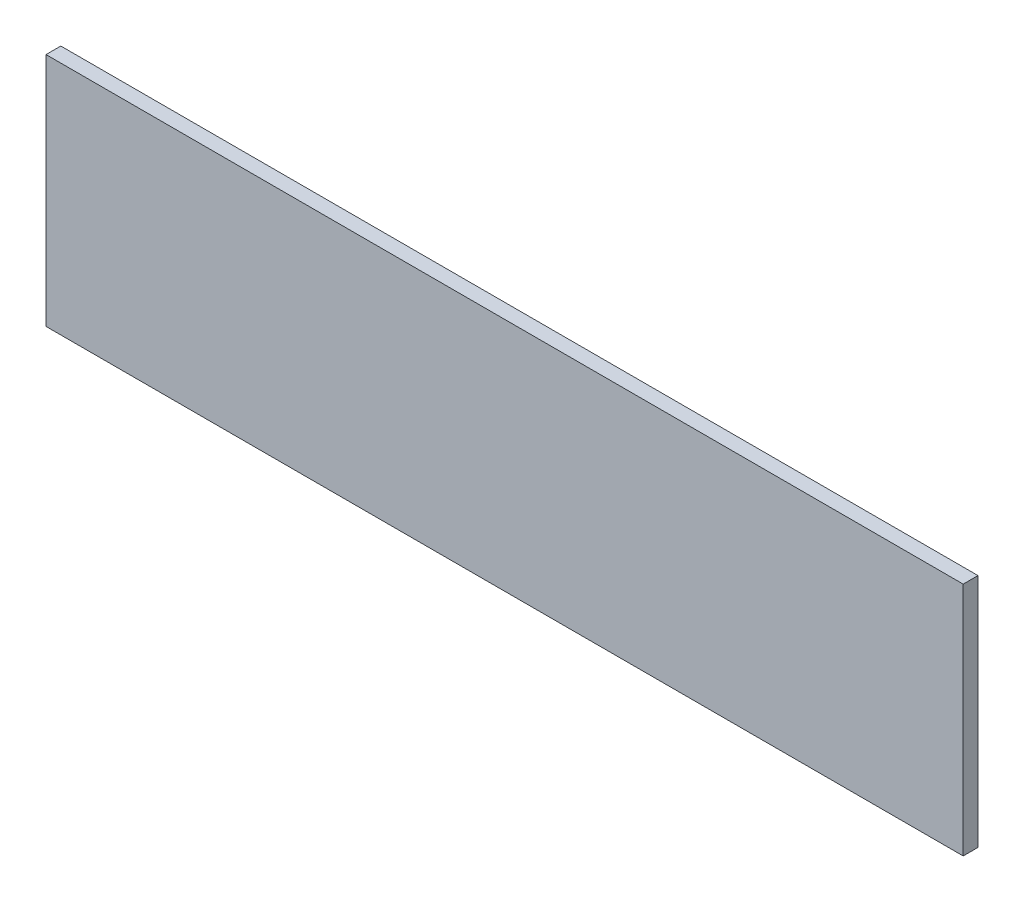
ISO-10303-21;
HEADER;
FILE_DESCRIPTION(('STEP AP214'),'2;1');
FILE_NAME('part.step','',(''),(''),'','','');
FILE_SCHEMA(('AUTOMOTIVE_DESIGN { 1 0 10303 214 1 1 1 1 }'));
ENDSEC;
DATA;
#1=APPLICATION_CONTEXT('core data for automotive mechanical design processes');
#2=APPLICATION_PROTOCOL_DEFINITION('international standard','automotive_design',2000,#1);
#3=PRODUCT_CONTEXT('',#1,'mechanical');
#4=PRODUCT('Part','Part','',(#3));
#5=PRODUCT_RELATED_PRODUCT_CATEGORY('part','',(#4));
#6=PRODUCT_DEFINITION_FORMATION('','',#4);
#7=PRODUCT_DEFINITION_CONTEXT('part definition',#1,'design');
#8=PRODUCT_DEFINITION('design','',#6,#7);
#9=PRODUCT_DEFINITION_SHAPE('','',#8);
#10=(LENGTH_UNIT() NAMED_UNIT(*) SI_UNIT(.MILLI.,.METRE.));
#11=(NAMED_UNIT(*) PLANE_ANGLE_UNIT() SI_UNIT($,.RADIAN.));
#12=(NAMED_UNIT(*) SI_UNIT($,.STERADIAN.) SOLID_ANGLE_UNIT());
#13=UNCERTAINTY_MEASURE_WITH_UNIT(LENGTH_MEASURE(1.E-05),#10,'distance_accuracy_value','');
#14=(GEOMETRIC_REPRESENTATION_CONTEXT(3) GLOBAL_UNCERTAINTY_ASSIGNED_CONTEXT((#13)) GLOBAL_UNIT_ASSIGNED_CONTEXT((#10,
#11,#12)) REPRESENTATION_CONTEXT('',''));
#15=CARTESIAN_POINT('',(0.,0.,0.));
#16=DIRECTION('',(0.,0.,1.));
#17=DIRECTION('',(1.,0.,0.));
#18=AXIS2_PLACEMENT_3D('',#15,#16,#17);
#19=CARTESIAN_POINT('',(590.55,-151.60625,9.525));
#20=DIRECTION('',(-1.,0.,0.));
#21=DIRECTION('',(0.,0.,1.));
#22=AXIS2_PLACEMENT_3D('',#19,#20,#21);
#23=PLANE('',#22);
#24=DIRECTION('',(0.,1.,0.));
#25=VECTOR('',#24,1.);
#26=CARTESIAN_POINT('',(590.55,-151.60625,-9.525));
#27=LINE('',#26,#25);
#28=CARTESIAN_POINT('',(590.55,-151.60625,-9.525));
#29=VERTEX_POINT('',#28);
#30=CARTESIAN_POINT('',(590.55,151.60625,-9.525));
#31=VERTEX_POINT('',#30);
#32=EDGE_CURVE('E93',#29,#31,#27,.T.);
#33=ORIENTED_EDGE('',*,*,#32,.T.);
#34=DIRECTION('',(0.,0.,-1.));
#35=VECTOR('',#34,1.);
#36=CARTESIAN_POINT('',(590.55,151.60625,9.525));
#37=LINE('',#36,#35);
#38=CARTESIAN_POINT('',(590.55,151.60625,9.525));
#39=VERTEX_POINT('',#38);
#40=EDGE_CURVE('E11',#39,#31,#37,.T.);
#41=ORIENTED_EDGE('',*,*,#40,.F.);
#42=DIRECTION('',(0.,1.,0.));
#43=VECTOR('',#42,1.);
#44=CARTESIAN_POINT('',(590.55,-151.60625,9.525));
#45=LINE('',#44,#43);
#46=CARTESIAN_POINT('',(590.55,-151.60625,9.525));
#47=VERTEX_POINT('',#46);
#48=EDGE_CURVE('E81',#47,#39,#45,.T.);
#49=ORIENTED_EDGE('',*,*,#48,.F.);
#50=DIRECTION('',(0.,0.,-1.));
#51=VECTOR('',#50,1.);
#52=CARTESIAN_POINT('',(590.55,-151.60625,9.525));
#53=LINE('',#52,#51);
#54=EDGE_CURVE('E89',#47,#29,#53,.T.);
#55=ORIENTED_EDGE('',*,*,#54,.T.);
#56=EDGE_LOOP('',(#33,#41,#49,#55));
#57=FACE_BOUND('',#56,.T.);
#58=ADVANCED_FACE('F30',(#57),#23,.F.);
#59=CARTESIAN_POINT('',(-590.55,151.60625,9.525));
#60=DIRECTION('',(0.,-1.,0.));
#61=DIRECTION('',(0.,0.,-1.));
#62=AXIS2_PLACEMENT_3D('',#59,#60,#61);
#63=PLANE('',#62);
#64=DIRECTION('',(-1.,0.,0.));
#65=VECTOR('',#64,1.);
#66=CARTESIAN_POINT('',(-590.55,151.60625,-9.525));
#67=LINE('',#66,#65);
#68=CARTESIAN_POINT('',(-590.55,151.60625,-9.525));
#69=VERTEX_POINT('',#68);
#70=EDGE_CURVE('E85',#31,#69,#67,.T.);
#71=ORIENTED_EDGE('',*,*,#70,.T.);
#72=DIRECTION('',(0.,0.,-1.));
#73=VECTOR('',#72,1.);
#74=CARTESIAN_POINT('',(-590.55,151.60625,9.525));
#75=LINE('',#74,#73);
#76=CARTESIAN_POINT('',(-590.55,151.60625,9.525));
#77=VERTEX_POINT('',#76);
#78=EDGE_CURVE('E38',#77,#69,#75,.T.);
#79=ORIENTED_EDGE('',*,*,#78,.F.);
#80=DIRECTION('',(-1.,0.,0.));
#81=VECTOR('',#80,1.);
#82=CARTESIAN_POINT('',(-590.55,151.60625,9.525));
#83=LINE('',#82,#81);
#84=EDGE_CURVE('E76',#39,#77,#83,.T.);
#85=ORIENTED_EDGE('',*,*,#84,.F.);
#86=ORIENTED_EDGE('',*,*,#40,.T.);
#87=EDGE_LOOP('',(#71,#79,#85,#86));
#88=FACE_BOUND('',#87,.T.);
#89=ADVANCED_FACE('F84',(#88),#63,.F.);
#90=CARTESIAN_POINT('',(-590.55,-151.60625,9.525));
#91=DIRECTION('',(1.,0.,0.));
#92=DIRECTION('',(0.,0.,-1.));
#93=AXIS2_PLACEMENT_3D('',#90,#91,#92);
#94=PLANE('',#93);
#95=DIRECTION('',(0.,-1.,0.));
#96=VECTOR('',#95,1.);
#97=CARTESIAN_POINT('',(-590.55,-151.60625,-9.525));
#98=LINE('',#97,#96);
#99=CARTESIAN_POINT('',(-590.55,-151.60625,-9.525));
#100=VERTEX_POINT('',#99);
#101=EDGE_CURVE('E63',#69,#100,#98,.T.);
#102=ORIENTED_EDGE('',*,*,#101,.T.);
#103=DIRECTION('',(0.,0.,-1.));
#104=VECTOR('',#103,1.);
#105=CARTESIAN_POINT('',(-590.55,-151.60625,9.525));
#106=LINE('',#105,#104);
#107=CARTESIAN_POINT('',(-590.55,-151.60625,9.525));
#108=VERTEX_POINT('',#107);
#109=EDGE_CURVE('E86',#108,#100,#106,.T.);
#110=ORIENTED_EDGE('',*,*,#109,.F.);
#111=DIRECTION('',(0.,-1.,0.));
#112=VECTOR('',#111,1.);
#113=CARTESIAN_POINT('',(-590.55,-151.60625,9.525));
#114=LINE('',#113,#112);
#115=EDGE_CURVE('E79',#77,#108,#114,.T.);
#116=ORIENTED_EDGE('',*,*,#115,.F.);
#117=ORIENTED_EDGE('',*,*,#78,.T.);
#118=EDGE_LOOP('',(#102,#110,#116,#117));
#119=FACE_BOUND('',#118,.T.);
#120=ADVANCED_FACE('F87',(#119),#94,.F.);
#121=CARTESIAN_POINT('',(-590.55,-151.60625,9.525));
#122=DIRECTION('',(0.,1.,0.));
#123=DIRECTION('',(0.,0.,1.));
#124=AXIS2_PLACEMENT_3D('',#121,#122,#123);
#125=PLANE('',#124);
#126=DIRECTION('',(1.,0.,0.));
#127=VECTOR('',#126,1.);
#128=CARTESIAN_POINT('',(-590.55,-151.60625,-9.525));
#129=LINE('',#128,#127);
#130=EDGE_CURVE('E69',#100,#29,#129,.T.);
#131=ORIENTED_EDGE('',*,*,#130,.T.);
#132=ORIENTED_EDGE('',*,*,#54,.F.);
#133=DIRECTION('',(1.,0.,0.));
#134=VECTOR('',#133,1.);
#135=CARTESIAN_POINT('',(-590.55,-151.60625,9.525));
#136=LINE('',#135,#134);
#137=EDGE_CURVE('E46',#108,#47,#136,.T.);
#138=ORIENTED_EDGE('',*,*,#137,.F.);
#139=ORIENTED_EDGE('',*,*,#109,.T.);
#140=EDGE_LOOP('',(#131,#132,#138,#139));
#141=FACE_BOUND('',#140,.T.);
#142=ADVANCED_FACE('F100',(#141),#125,.F.);
#143=CARTESIAN_POINT('',(590.55,151.60625,9.525));
#144=DIRECTION('',(0.,0.,-1.));
#145=DIRECTION('',(-1.,0.,0.));
#146=AXIS2_PLACEMENT_3D('',#143,#144,#145);
#147=PLANE('',#146);
#148=ORIENTED_EDGE('',*,*,#48,.T.);
#149=ORIENTED_EDGE('',*,*,#84,.T.);
#150=ORIENTED_EDGE('',*,*,#115,.T.);
#151=ORIENTED_EDGE('',*,*,#137,.T.);
#152=EDGE_LOOP('',(#148,#149,#150,#151));
#153=FACE_BOUND('',#152,.T.);
#154=ADVANCED_FACE('F77',(#153),#147,.F.);
#155=CARTESIAN_POINT('',(590.55,151.60625,-9.525));
#156=DIRECTION('',(0.,0.,-1.));
#157=DIRECTION('',(-1.,0.,0.));
#158=AXIS2_PLACEMENT_3D('',#155,#156,#157);
#159=PLANE('',#158);
#160=ORIENTED_EDGE('',*,*,#32,.F.);
#161=ORIENTED_EDGE('',*,*,#130,.F.);
#162=ORIENTED_EDGE('',*,*,#101,.F.);
#163=ORIENTED_EDGE('',*,*,#70,.F.);
#164=EDGE_LOOP('',(#160,#161,#162,#163));
#165=FACE_BOUND('',#164,.T.);
#166=ADVANCED_FACE('F103',(#165),#159,.T.);
#167=CLOSED_SHELL('',(#58,#89,#120,#142,#154,#166));
#168=MANIFOLD_SOLID_BREP('B2',#167);
#169=ADVANCED_BREP_SHAPE_REPRESENTATION('',(#18,#168),#14);
#170=SHAPE_DEFINITION_REPRESENTATION(#9,#169);
ENDSEC;
END-ISO-10303-21;
